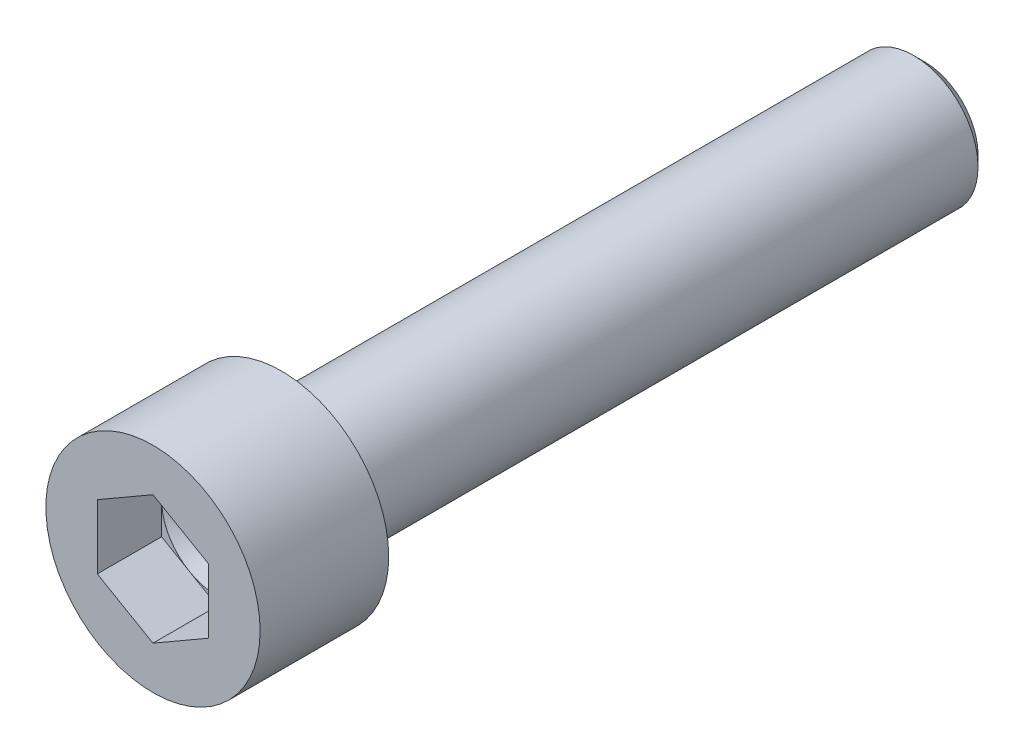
ISO-10303-21;
HEADER;
FILE_DESCRIPTION(('STEP AP214'),'2;1');
FILE_NAME('part.step','',(''),(''),'','','');
FILE_SCHEMA(('AUTOMOTIVE_DESIGN { 1 0 10303 214 1 1 1 1 }'));
ENDSEC;
DATA;
#1=APPLICATION_CONTEXT('core data for automotive mechanical design processes');
#2=APPLICATION_PROTOCOL_DEFINITION('international standard','automotive_design',2000,#1);
#3=PRODUCT_CONTEXT('',#1,'mechanical');
#4=PRODUCT('Part','Part','',(#3));
#5=PRODUCT_RELATED_PRODUCT_CATEGORY('part','',(#4));
#6=PRODUCT_DEFINITION_FORMATION('','',#4);
#7=PRODUCT_DEFINITION_CONTEXT('part definition',#1,'design');
#8=PRODUCT_DEFINITION('design','',#6,#7);
#9=PRODUCT_DEFINITION_SHAPE('','',#8);
#10=(LENGTH_UNIT() NAMED_UNIT(*) SI_UNIT(.MILLI.,.METRE.));
#11=(NAMED_UNIT(*) PLANE_ANGLE_UNIT() SI_UNIT($,.RADIAN.));
#12=(NAMED_UNIT(*) SI_UNIT($,.STERADIAN.) SOLID_ANGLE_UNIT());
#13=UNCERTAINTY_MEASURE_WITH_UNIT(LENGTH_MEASURE(1.E-05),#10,'distance_accuracy_value','');
#14=(GEOMETRIC_REPRESENTATION_CONTEXT(3) GLOBAL_UNCERTAINTY_ASSIGNED_CONTEXT((#13)) GLOBAL_UNIT_ASSIGNED_CONTEXT((#10,
#11,#12)) REPRESENTATION_CONTEXT('',''));
#15=CARTESIAN_POINT('',(0.,0.,0.));
#16=DIRECTION('',(0.,0.,1.));
#17=DIRECTION('',(1.,0.,0.));
#18=AXIS2_PLACEMENT_3D('',#15,#16,#17);
#19=CARTESIAN_POINT('',(0.,0.,-6.));
#20=DIRECTION('',(0.,0.,1.));
#21=DIRECTION('',(1.,0.,0.));
#22=AXIS2_PLACEMENT_3D('',#19,#20,#21);
#23=PLANE('',#22);
#24=CARTESIAN_POINT('',(0.,0.,-6.));
#25=DIRECTION('',(0.,0.,1.));
#26=DIRECTION('',(1.,0.,0.));
#27=AXIS2_PLACEMENT_3D('',#24,#25,#26);
#28=CIRCLE('',#27,5.);
#29=CARTESIAN_POINT('',(5.,0.,-6.));
#30=VERTEX_POINT('',#29);
#31=EDGE_CURVE('E142',#30,#30,#28,.T.);
#32=ORIENTED_EDGE('',*,*,#31,.F.);
#33=EDGE_LOOP('',(#32));
#34=FACE_BOUND('',#33,.T.);
#35=CARTESIAN_POINT('',(0.,0.,-6.));
#36=DIRECTION('',(0.,0.,1.));
#37=DIRECTION('',(1.,0.,0.));
#38=AXIS2_PLACEMENT_3D('',#35,#36,#37);
#39=CIRCLE('',#38,3.);
#40=CARTESIAN_POINT('',(3.,0.,-6.));
#41=VERTEX_POINT('',#40);
#42=EDGE_CURVE('E145',#41,#41,#39,.F.);
#43=ORIENTED_EDGE('',*,*,#42,.F.);
#44=EDGE_LOOP('',(#43));
#45=FACE_BOUND('',#44,.T.);
#46=ADVANCED_FACE('F28',(#34,#45),#23,.F.);
#47=CARTESIAN_POINT('',(0.,0.,-6.));
#48=DIRECTION('',(0.,0.,1.));
#49=DIRECTION('',(1.,0.,0.));
#50=AXIS2_PLACEMENT_3D('',#47,#48,#49);
#51=CYLINDRICAL_SURFACE('',#50,5.);
#52=ORIENTED_EDGE('',*,*,#31,.T.);
#53=EDGE_LOOP('',(#52));
#54=FACE_BOUND('',#53,.T.);
#55=CARTESIAN_POINT('',(0.,0.,0.));
#56=DIRECTION('',(0.,0.,1.));
#57=DIRECTION('',(1.,0.,0.));
#58=AXIS2_PLACEMENT_3D('',#55,#56,#57);
#59=CIRCLE('',#58,5.);
#60=CARTESIAN_POINT('',(5.,0.,0.));
#61=VERTEX_POINT('',#60);
#62=EDGE_CURVE('E130',#61,#61,#59,.T.);
#63=ORIENTED_EDGE('',*,*,#62,.F.);
#64=EDGE_LOOP('',(#63));
#65=FACE_BOUND('',#64,.T.);
#66=ADVANCED_FACE('F30',(#54,#65),#51,.T.);
#67=CARTESIAN_POINT('',(0.,0.,0.));
#68=DIRECTION('',(0.,0.,1.));
#69=DIRECTION('',(1.,0.,0.));
#70=AXIS2_PLACEMENT_3D('',#67,#68,#69);
#71=PLANE('',#70);
#72=DIRECTION('',(0.866025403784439,-0.5,0.));
#73=VECTOR('',#72,1.);
#74=CARTESIAN_POINT('',(-2.59807621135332,-1.5,0.));
#75=LINE('',#74,#73);
#76=CARTESIAN_POINT('',(-2.59807621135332,-1.5,0.));
#77=VERTEX_POINT('',#76);
#78=CARTESIAN_POINT('',(0.,-3.,0.));
#79=VERTEX_POINT('',#78);
#80=EDGE_CURVE('E43',#77,#79,#75,.T.);
#81=ORIENTED_EDGE('',*,*,#80,.F.);
#82=DIRECTION('',(0.,-1.,0.));
#83=VECTOR('',#82,1.);
#84=CARTESIAN_POINT('',(-2.59807621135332,1.5,0.));
#85=LINE('',#84,#83);
#86=CARTESIAN_POINT('',(-2.59807621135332,1.5,0.));
#87=VERTEX_POINT('',#86);
#88=EDGE_CURVE('E113',#87,#77,#85,.T.);
#89=ORIENTED_EDGE('',*,*,#88,.F.);
#90=DIRECTION('',(-0.866025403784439,-0.5,0.));
#91=VECTOR('',#90,1.);
#92=CARTESIAN_POINT('',(0.,3.,0.));
#93=LINE('',#92,#91);
#94=CARTESIAN_POINT('',(0.,3.,0.));
#95=VERTEX_POINT('',#94);
#96=EDGE_CURVE('E110',#95,#87,#93,.T.);
#97=ORIENTED_EDGE('',*,*,#96,.F.);
#98=DIRECTION('',(-0.866025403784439,0.5,0.));
#99=VECTOR('',#98,1.);
#100=CARTESIAN_POINT('',(2.59807621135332,1.5,0.));
#101=LINE('',#100,#99);
#102=CARTESIAN_POINT('',(2.59807621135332,1.5,0.));
#103=VERTEX_POINT('',#102);
#104=EDGE_CURVE('E107',#103,#95,#101,.T.);
#105=ORIENTED_EDGE('',*,*,#104,.F.);
#106=DIRECTION('',(0.,1.,0.));
#107=VECTOR('',#106,1.);
#108=CARTESIAN_POINT('',(2.59807621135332,-1.5,0.));
#109=LINE('',#108,#107);
#110=CARTESIAN_POINT('',(2.59807621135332,-1.5,0.));
#111=VERTEX_POINT('',#110);
#112=EDGE_CURVE('E104',#111,#103,#109,.T.);
#113=ORIENTED_EDGE('',*,*,#112,.F.);
#114=DIRECTION('',(0.866025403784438,0.5,0.));
#115=VECTOR('',#114,1.);
#116=CARTESIAN_POINT('',(0.,-3.,0.));
#117=LINE('',#116,#115);
#118=EDGE_CURVE('E95',#79,#111,#117,.T.);
#119=ORIENTED_EDGE('',*,*,#118,.F.);
#120=EDGE_LOOP('',(#81,#89,#97,#105,#113,#119));
#121=FACE_BOUND('',#120,.T.);
#122=ORIENTED_EDGE('',*,*,#62,.T.);
#123=EDGE_LOOP('',(#122));
#124=FACE_BOUND('',#123,.T.);
#125=ADVANCED_FACE('F169',(#121,#124),#71,.T.);
#126=CARTESIAN_POINT('',(0.,0.,-36.));
#127=DIRECTION('',(0.,0.,1.));
#128=DIRECTION('',(1.,0.,0.));
#129=AXIS2_PLACEMENT_3D('',#126,#127,#128);
#130=CYLINDRICAL_SURFACE('',#129,3.);
#131=CARTESIAN_POINT('',(0.,0.,-35.5));
#132=DIRECTION('',(0.,0.,-1.));
#133=DIRECTION('',(-1.,0.,0.));
#134=AXIS2_PLACEMENT_3D('',#131,#132,#133);
#135=CIRCLE('',#134,3.);
#136=CARTESIAN_POINT('',(-3.,0.,-35.5));
#137=VERTEX_POINT('',#136);
#138=EDGE_CURVE('E11',#137,#137,#135,.F.);
#139=ORIENTED_EDGE('',*,*,#138,.T.);
#140=EDGE_LOOP('',(#139));
#141=FACE_BOUND('',#140,.T.);
#142=ORIENTED_EDGE('',*,*,#42,.T.);
#143=EDGE_LOOP('',(#142));
#144=FACE_BOUND('',#143,.T.);
#145=ADVANCED_FACE('F176',(#141,#144),#130,.T.);
#146=CARTESIAN_POINT('',(0.,0.,-36.));
#147=DIRECTION('',(0.,0.,-1.));
#148=DIRECTION('',(-1.,0.,0.));
#149=AXIS2_PLACEMENT_3D('',#146,#147,#148);
#150=PLANE('',#149);
#151=CARTESIAN_POINT('',(0.,0.,-36.));
#152=DIRECTION('',(0.,0.,-1.));
#153=DIRECTION('',(-1.,0.,0.));
#154=AXIS2_PLACEMENT_3D('',#151,#152,#153);
#155=CIRCLE('',#154,2.5);
#156=CARTESIAN_POINT('',(-2.5,0.,-36.));
#157=VERTEX_POINT('',#156);
#158=EDGE_CURVE('E36',#157,#157,#155,.T.);
#159=ORIENTED_EDGE('',*,*,#158,.T.);
#160=EDGE_LOOP('',(#159));
#161=FACE_BOUND('',#160,.T.);
#162=ADVANCED_FACE('F150',(#161),#150,.T.);
#163=CARTESIAN_POINT('',(-2.59807621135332,-1.5,-3.));
#164=DIRECTION('',(-0.5,-0.866025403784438,0.));
#165=DIRECTION('',(0.866025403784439,-0.5,0.));
#166=AXIS2_PLACEMENT_3D('',#163,#164,#165);
#167=PLANE('',#166);
#168=ORIENTED_EDGE('',*,*,#80,.T.);
#169=DIRECTION('',(0.,0.,1.));
#170=VECTOR('',#169,1.);
#171=CARTESIAN_POINT('',(0.,-3.,-3.));
#172=LINE('',#171,#170);
#173=CARTESIAN_POINT('',(0.,-3.,-3.));
#174=VERTEX_POINT('',#173);
#175=EDGE_CURVE('E127',#174,#79,#172,.T.);
#176=ORIENTED_EDGE('',*,*,#175,.F.);
#177=DIRECTION('',(0.866025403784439,-0.5,0.));
#178=VECTOR('',#177,1.);
#179=CARTESIAN_POINT('',(-2.59807621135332,-1.5,-3.));
#180=LINE('',#179,#178);
#181=CARTESIAN_POINT('',(-2.59807621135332,-1.5,-3.));
#182=VERTEX_POINT('',#181);
#183=EDGE_CURVE('E116',#182,#174,#180,.T.);
#184=ORIENTED_EDGE('',*,*,#183,.F.);
#185=DIRECTION('',(0.,0.,1.));
#186=VECTOR('',#185,1.);
#187=CARTESIAN_POINT('',(-2.59807621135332,-1.5,-3.));
#188=LINE('',#187,#186);
#189=EDGE_CURVE('E128',#182,#77,#188,.T.);
#190=ORIENTED_EDGE('',*,*,#189,.T.);
#191=EDGE_LOOP('',(#168,#176,#184,#190));
#192=FACE_BOUND('',#191,.T.);
#193=ADVANCED_FACE('F183',(#192),#167,.F.);
#194=CARTESIAN_POINT('',(-2.59807621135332,1.5,-3.));
#195=DIRECTION('',(-1.,0.,0.));
#196=DIRECTION('',(0.,0.,1.));
#197=AXIS2_PLACEMENT_3D('',#194,#195,#196);
#198=PLANE('',#197);
#199=ORIENTED_EDGE('',*,*,#88,.T.);
#200=ORIENTED_EDGE('',*,*,#189,.F.);
#201=DIRECTION('',(0.,-1.,0.));
#202=VECTOR('',#201,1.);
#203=CARTESIAN_POINT('',(-2.59807621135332,1.5,-3.));
#204=LINE('',#203,#202);
#205=CARTESIAN_POINT('',(-2.59807621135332,1.5,-3.));
#206=VERTEX_POINT('',#205);
#207=EDGE_CURVE('E125',#206,#182,#204,.T.);
#208=ORIENTED_EDGE('',*,*,#207,.F.);
#209=DIRECTION('',(0.,0.,1.));
#210=VECTOR('',#209,1.);
#211=CARTESIAN_POINT('',(-2.59807621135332,1.5,-3.));
#212=LINE('',#211,#210);
#213=EDGE_CURVE('E131',#206,#87,#212,.T.);
#214=ORIENTED_EDGE('',*,*,#213,.T.);
#215=EDGE_LOOP('',(#199,#200,#208,#214));
#216=FACE_BOUND('',#215,.T.);
#217=ADVANCED_FACE('F186',(#216),#198,.F.);
#218=CARTESIAN_POINT('',(0.,3.,-3.));
#219=DIRECTION('',(-0.5,0.866025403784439,0.));
#220=DIRECTION('',(-0.866025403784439,-0.5,0.));
#221=AXIS2_PLACEMENT_3D('',#218,#219,#220);
#222=PLANE('',#221);
#223=ORIENTED_EDGE('',*,*,#96,.T.);
#224=ORIENTED_EDGE('',*,*,#213,.F.);
#225=DIRECTION('',(-0.866025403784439,-0.5,0.));
#226=VECTOR('',#225,1.);
#227=CARTESIAN_POINT('',(0.,3.,-3.));
#228=LINE('',#227,#226);
#229=CARTESIAN_POINT('',(0.,3.,-3.));
#230=VERTEX_POINT('',#229);
#231=EDGE_CURVE('E51',#230,#206,#228,.T.);
#232=ORIENTED_EDGE('',*,*,#231,.F.);
#233=DIRECTION('',(0.,0.,1.));
#234=VECTOR('',#233,1.);
#235=CARTESIAN_POINT('',(0.,3.,-3.));
#236=LINE('',#235,#234);
#237=EDGE_CURVE('E133',#230,#95,#236,.T.);
#238=ORIENTED_EDGE('',*,*,#237,.T.);
#239=EDGE_LOOP('',(#223,#224,#232,#238));
#240=FACE_BOUND('',#239,.T.);
#241=ADVANCED_FACE('F198',(#240),#222,.F.);
#242=CARTESIAN_POINT('',(2.59807621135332,1.5,-3.));
#243=DIRECTION('',(0.5,0.866025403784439,0.));
#244=DIRECTION('',(-0.866025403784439,0.5,0.));
#245=AXIS2_PLACEMENT_3D('',#242,#243,#244);
#246=PLANE('',#245);
#247=ORIENTED_EDGE('',*,*,#104,.T.);
#248=ORIENTED_EDGE('',*,*,#237,.F.);
#249=DIRECTION('',(-0.866025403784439,0.5,0.));
#250=VECTOR('',#249,1.);
#251=CARTESIAN_POINT('',(2.59807621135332,1.5,-3.));
#252=LINE('',#251,#250);
#253=CARTESIAN_POINT('',(2.59807621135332,1.5,-3.));
#254=VERTEX_POINT('',#253);
#255=EDGE_CURVE('E122',#254,#230,#252,.T.);
#256=ORIENTED_EDGE('',*,*,#255,.F.);
#257=DIRECTION('',(0.,0.,1.));
#258=VECTOR('',#257,1.);
#259=CARTESIAN_POINT('',(2.59807621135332,1.5,-3.));
#260=LINE('',#259,#258);
#261=EDGE_CURVE('E135',#254,#103,#260,.T.);
#262=ORIENTED_EDGE('',*,*,#261,.T.);
#263=EDGE_LOOP('',(#247,#248,#256,#262));
#264=FACE_BOUND('',#263,.T.);
#265=ADVANCED_FACE('F194',(#264),#246,.F.);
#266=CARTESIAN_POINT('',(2.59807621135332,-1.5,-3.));
#267=DIRECTION('',(1.,0.,0.));
#268=DIRECTION('',(0.,1.,0.));
#269=AXIS2_PLACEMENT_3D('',#266,#267,#268);
#270=PLANE('',#269);
#271=ORIENTED_EDGE('',*,*,#112,.T.);
#272=ORIENTED_EDGE('',*,*,#261,.F.);
#273=DIRECTION('',(0.,1.,0.));
#274=VECTOR('',#273,1.);
#275=CARTESIAN_POINT('',(2.59807621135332,-1.5,-3.));
#276=LINE('',#275,#274);
#277=CARTESIAN_POINT('',(2.59807621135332,-1.5,-3.));
#278=VERTEX_POINT('',#277);
#279=EDGE_CURVE('E120',#278,#254,#276,.T.);
#280=ORIENTED_EDGE('',*,*,#279,.F.);
#281=DIRECTION('',(0.,0.,1.));
#282=VECTOR('',#281,1.);
#283=CARTESIAN_POINT('',(2.59807621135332,-1.5,-3.));
#284=LINE('',#283,#282);
#285=EDGE_CURVE('E137',#278,#111,#284,.T.);
#286=ORIENTED_EDGE('',*,*,#285,.T.);
#287=EDGE_LOOP('',(#271,#272,#280,#286));
#288=FACE_BOUND('',#287,.T.);
#289=ADVANCED_FACE('F190',(#288),#270,.F.);
#290=CARTESIAN_POINT('',(0.,-3.,-3.));
#291=DIRECTION('',(0.500000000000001,-0.866025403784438,0.));
#292=DIRECTION('',(0.866025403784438,0.500000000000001,0.));
#293=AXIS2_PLACEMENT_3D('',#290,#291,#292);
#294=PLANE('',#293);
#295=ORIENTED_EDGE('',*,*,#118,.T.);
#296=ORIENTED_EDGE('',*,*,#285,.F.);
#297=DIRECTION('',(0.866025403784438,0.5,0.));
#298=VECTOR('',#297,1.);
#299=CARTESIAN_POINT('',(0.,-3.,-3.));
#300=LINE('',#299,#298);
#301=EDGE_CURVE('E118',#174,#278,#300,.T.);
#302=ORIENTED_EDGE('',*,*,#301,.F.);
#303=ORIENTED_EDGE('',*,*,#175,.T.);
#304=EDGE_LOOP('',(#295,#296,#302,#303));
#305=FACE_BOUND('',#304,.T.);
#306=ADVANCED_FACE('F187',(#305),#294,.F.);
#307=CARTESIAN_POINT('',(3.7625782,0.,-3.));
#308=DIRECTION('',(0.,0.,1.));
#309=DIRECTION('',(1.,0.,0.));
#310=AXIS2_PLACEMENT_3D('',#307,#308,#309);
#311=PLANE('',#310);
#312=ORIENTED_EDGE('',*,*,#183,.T.);
#313=ORIENTED_EDGE('',*,*,#301,.T.);
#314=ORIENTED_EDGE('',*,*,#279,.T.);
#315=ORIENTED_EDGE('',*,*,#255,.T.);
#316=ORIENTED_EDGE('',*,*,#231,.T.);
#317=ORIENTED_EDGE('',*,*,#207,.T.);
#318=EDGE_LOOP('',(#312,#313,#314,#315,#316,#317));
#319=FACE_BOUND('',#318,.T.);
#320=CARTESIAN_POINT('',(0.,0.,-3.));
#321=DIRECTION('',(0.,0.,1.));
#322=DIRECTION('',(1.,0.,0.));
#323=AXIS2_PLACEMENT_3D('',#320,#321,#322);
#324=CIRCLE('',#323,3.7625782);
#325=CARTESIAN_POINT('',(3.7625782,0.,-3.));
#326=VERTEX_POINT('',#325);
#327=EDGE_CURVE('E218',#326,#326,#324,.T.);
#328=ORIENTED_EDGE('',*,*,#327,.F.);
#329=EDGE_LOOP('',(#328));
#330=FACE_BOUND('',#329,.T.);
#331=ADVANCED_FACE('F87',(#319,#330),#311,.F.);
#332=CARTESIAN_POINT('',(0.,0.,-3.0002));
#333=DIRECTION('',(0.,0.,1.));
#334=DIRECTION('',(1.,0.,0.));
#335=AXIS2_PLACEMENT_3D('',#332,#333,#334);
#336=CONICAL_SURFACE('',#335,2.5999948,1.02974425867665);
#337=CARTESIAN_POINT('',(0.,0.,-4.56243448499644));
#338=VERTEX_POINT('',#337);
#339=VERTEX_LOOP('',#338);
#340=FACE_BOUND('',#339,.T.);
#341=CARTESIAN_POINT('',(0.,0.,-3.0002));
#342=DIRECTION('',(0.,0.,1.));
#343=DIRECTION('',(1.,0.,0.));
#344=AXIS2_PLACEMENT_3D('',#341,#342,#343);
#345=CIRCLE('',#344,2.5999948);
#346=CARTESIAN_POINT('',(2.5999948,0.,-3.0002));
#347=VERTEX_POINT('',#346);
#348=EDGE_CURVE('E91',#347,#347,#345,.T.);
#349=ORIENTED_EDGE('',*,*,#348,.T.);
#350=EDGE_LOOP('',(#349));
#351=FACE_BOUND('',#350,.T.);
#352=ADVANCED_FACE('F83',(#340,#351),#336,.F.);
#353=CARTESIAN_POINT('',(0.,0.,-3.));
#354=DIRECTION('',(0.,0.,1.));
#355=DIRECTION('',(1.,0.,0.));
#356=AXIS2_PLACEMENT_3D('',#353,#354,#355);
#357=CYLINDRICAL_SURFACE('',#356,2.5999948);
#358=ORIENTED_EDGE('',*,*,#348,.F.);
#359=EDGE_LOOP('',(#358));
#360=FACE_BOUND('',#359,.T.);
#361=CARTESIAN_POINT('',(0.,0.,-3.0001));
#362=DIRECTION('',(0.,0.,1.));
#363=DIRECTION('',(1.,0.,0.));
#364=AXIS2_PLACEMENT_3D('',#361,#362,#363);
#365=CIRCLE('',#364,2.59999480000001);
#366=CARTESIAN_POINT('',(2.59999480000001,0.,-3.0001));
#367=VERTEX_POINT('',#366);
#368=EDGE_CURVE('E93',#367,#367,#365,.T.);
#369=ORIENTED_EDGE('',*,*,#368,.T.);
#370=EDGE_LOOP('',(#369));
#371=FACE_BOUND('',#370,.T.);
#372=ADVANCED_FACE('F86',(#360,#371),#357,.F.);
#373=CARTESIAN_POINT('',(2.59999480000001,0.,-3.0001));
#374=DIRECTION('',(0.,0.,-1.));
#375=DIRECTION('',(-1.,0.,0.));
#376=AXIS2_PLACEMENT_3D('',#373,#374,#375);
#377=PLANE('',#376);
#378=ORIENTED_EDGE('',*,*,#368,.F.);
#379=EDGE_LOOP('',(#378));
#380=FACE_BOUND('',#379,.T.);
#381=CARTESIAN_POINT('',(0.,0.,-3.0001));
#382=DIRECTION('',(0.,0.,1.));
#383=DIRECTION('',(1.,0.,0.));
#384=AXIS2_PLACEMENT_3D('',#381,#382,#383);
#385=CIRCLE('',#384,3.76257520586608);
#386=CARTESIAN_POINT('',(3.76257520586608,0.,-3.0001));
#387=VERTEX_POINT('',#386);
#388=EDGE_CURVE('E98',#387,#387,#385,.T.);
#389=ORIENTED_EDGE('',*,*,#388,.T.);
#390=EDGE_LOOP('',(#389));
#391=FACE_BOUND('',#390,.T.);
#392=ADVANCED_FACE('F160',(#380,#391),#377,.F.);
#393=CARTESIAN_POINT('',(0.,0.,-3.));
#394=DIRECTION('',(0.,0.,1.));
#395=DIRECTION('',(1.,0.,0.));
#396=AXIS2_PLACEMENT_3D('',#393,#394,#395);
#397=CYLINDRICAL_SURFACE('',#396,3.76257670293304);
#398=ORIENTED_EDGE('',*,*,#388,.F.);
#399=EDGE_LOOP('',(#398));
#400=FACE_BOUND('',#399,.T.);
#401=ORIENTED_EDGE('',*,*,#327,.T.);
#402=EDGE_LOOP('',(#401));
#403=FACE_BOUND('',#402,.T.);
#404=ADVANCED_FACE('F154',(#400,#403),#397,.F.);
#405=CARTESIAN_POINT('',(0.,0.,-36.));
#406=DIRECTION('',(0.,0.,1.));
#407=DIRECTION('',(1.,0.,0.));
#408=AXIS2_PLACEMENT_3D('',#405,#406,#407);
#409=CONICAL_SURFACE('',#408,2.5,0.785398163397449);
#410=ORIENTED_EDGE('',*,*,#138,.F.);
#411=EDGE_LOOP('',(#410));
#412=FACE_BOUND('',#411,.T.);
#413=ORIENTED_EDGE('',*,*,#158,.F.);
#414=EDGE_LOOP('',(#413));
#415=FACE_BOUND('',#414,.T.);
#416=ADVANCED_FACE('F152',(#412,#415),#409,.T.);
#417=CLOSED_SHELL('',(#46,#66,#125,#145,#162,#193,#217,#241,#265,#289,#306,#331,#352,#372,#392,
#404,#416));
#418=MANIFOLD_SOLID_BREP('B2',#417);
#419=ADVANCED_BREP_SHAPE_REPRESENTATION('',(#18,#418),#14);
#420=SHAPE_DEFINITION_REPRESENTATION(#9,#419);
ENDSEC;
END-ISO-10303-21;
